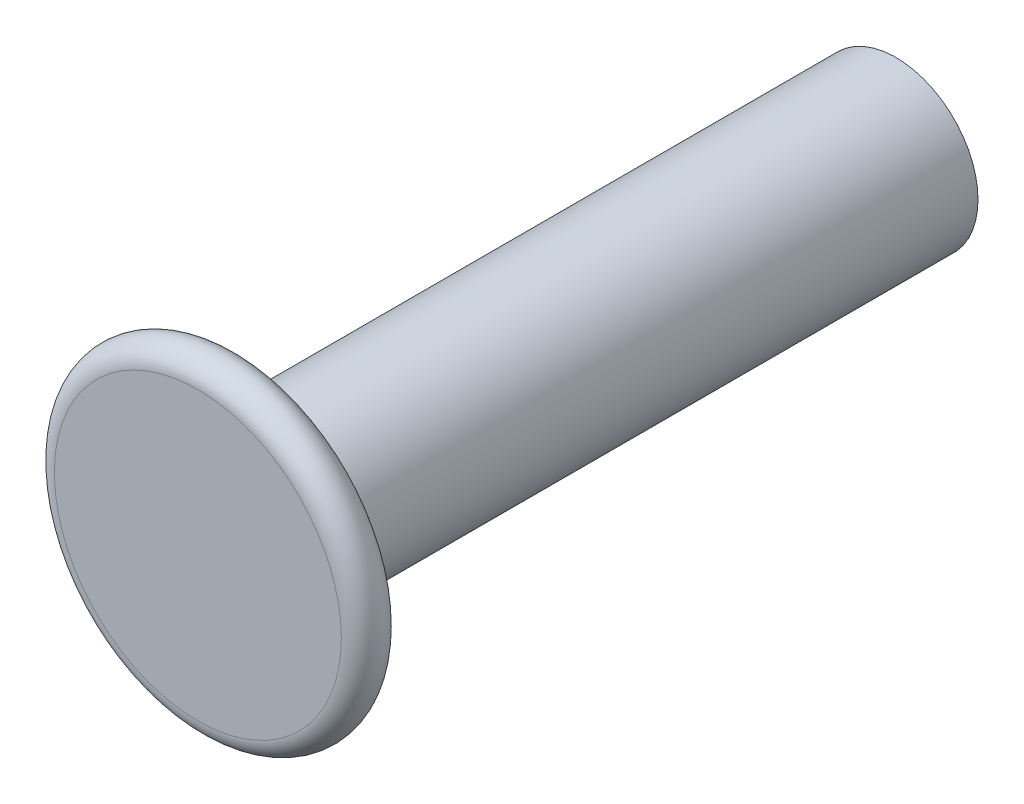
from build123d import *


with BuildPart() as part:
    # BaseBodySke → BaseBody (revolve)
    with BuildSketch(Plane(origin=(0, 0, 0), x_dir=(1, 0, 0), z_dir=(0, 1, 0)), mode=Mode.PRIVATE) as basebody_sk:
        with BuildLine():
            Line((0, 0), (-5.5499, 0))
            ThreePointArc((-5.5499, 0), (-6.35, 0.8001), (-5.5499, 1.6002))
            Line((-5.5499, 1.6002), (-3.175, 1.6002))
            Line((-3.175, 1.6002), (-3.175, 27.0002))
            Line((-3.175, 27.0002), (0, 27.0002))
            Line((0, 27.0002), (0, 0))
        make_face()
    revolve(basebody_sk.sketch.rotate(Axis((0, 0, 0), (0, 0, -1)), 180), axis=Axis((0, 0, 0), (0, 0, -1)))


solid = part.part
